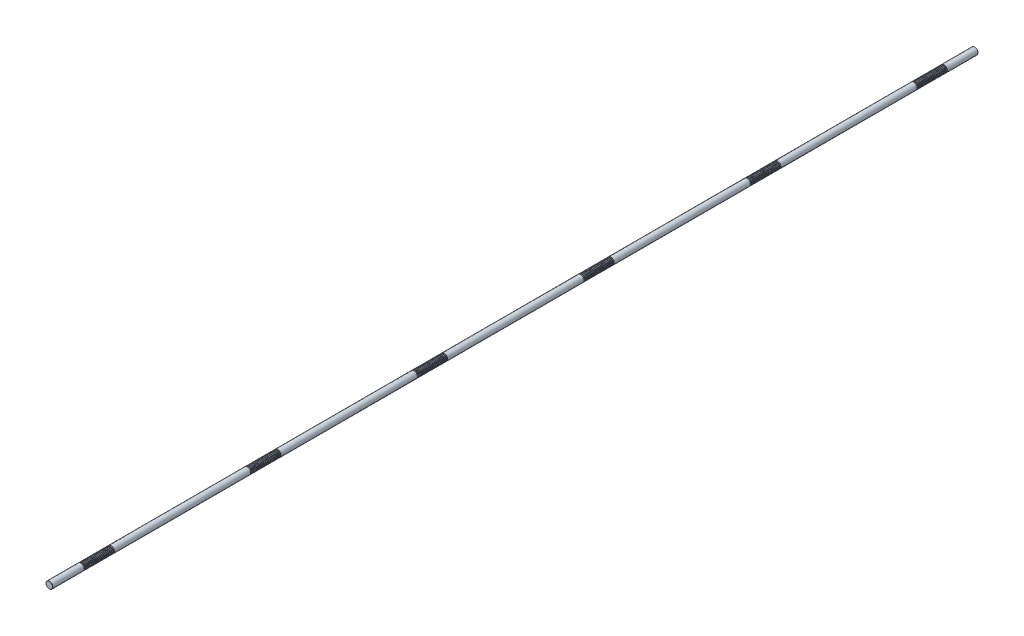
from build123d import *

# Parameters (mm, degrees)
SKETCH1_R           = 11
BOSS_EXTRUDE1_DEPTH = 1500
CHAMFER1_SIZE       = 0.55
LPATTERN1_COUNT     = 20
LPATTERN1_PITCH     = 5
LPATTERN2_COUNT     = 6
LPATTERN2_PITCH     = 540


with BuildPart() as part:
    # Sketch1 → Boss-Extrude1 (new, symmetric)
    with BuildSketch(Plane.XY):
        Circle(SKETCH1_R)
    extrude(amount=BOSS_EXTRUDE1_DEPTH, both=True)

    # Chamfer1
    chamfer1_edges = [part.edges().sort_by_distance(p)[0] for p in [
        (-11, 0, -1500),
        (-11, 0, 1500),
    ]]
    chamfer(chamfer1_edges, length=CHAMFER1_SIZE)

    # Sketch2 → Cut-Revolve1 (revolve, cut)
    with BuildSketch(Plane(origin=(0, 0, 0), x_dir=(0, 0, -1), z_dir=(1, 0, 0)), mode=Mode.PRIVATE) as cut_revolve1_sk:
        Polygon((1400.36843014, 11), (1397.13156986, 11), (1397.86843014, 8.25), (1399.63156986, 8.25), align=None)
    cut_revolve1 = revolve(cut_revolve1_sk.sketch.rotate(Axis((0, 0, 1500), (0, 0, -1)), 90), axis=Axis((0, 0, 1500), (0, 0, -1)), mode=Mode.SUBTRACT)

    # LPattern1: Cut-Revolve1 ×20
    with Locations(*[(0, 0, i * LPATTERN1_PITCH) for i in range(1, LPATTERN1_COUNT)]):
        add(cut_revolve1, mode=Mode.SUBTRACT)

    # LPattern2: Cut-Revolve1 ×6
    with Locations(*[(0, 0, i * LPATTERN2_PITCH) for i in range(1, LPATTERN2_COUNT)]):
        add(cut_revolve1, mode=Mode.SUBTRACT)

    # LPattern2 copy 1 sketch → LPattern2 copy 1 (revolve, cut)
    with BuildSketch(Plane(origin=(0, 0, 545), x_dir=(0, 0, -1), z_dir=(1, 0, 0))):
        Polygon((1400.36843014, 11), (1397.13156986, 11), (1397.86843014, 8.25), (1399.63156986, 8.25), align=None)
    revolve(axis=Axis((0, 0, 2045), (0, 0, -1)), mode=Mode.SUBTRACT)

    # LPattern2 copy 2 sketch → LPattern2 copy 2 (revolve, cut)
    with BuildSketch(Plane(origin=(0, 0, 1085), x_dir=(0, 0, -1), z_dir=(1, 0, 0))):
        Polygon((1400.36843014, 11), (1397.13156986, 11), (1397.86843014, 8.25), (1399.63156986, 8.25), align=None)
    revolve(axis=Axis((0, 0, 2585), (0, 0, -1)), mode=Mode.SUBTRACT)

    # LPattern2 copy 3 sketch → LPattern2 copy 3 (revolve, cut)
    with BuildSketch(Plane(origin=(0, 0, 1625), x_dir=(0, 0, -1), z_dir=(1, 0, 0))):
        Polygon((1400.36843014, 11), (1397.13156986, 11), (1397.86843014, 8.25), (1399.63156986, 8.25), align=None)
    revolve(axis=Axis((0, 0, 3125), (0, 0, -1)), mode=Mode.SUBTRACT)

    # LPattern2 copy 4 sketch → LPattern2 copy 4 (revolve, cut)
    with BuildSketch(Plane(origin=(0, 0, 2165), x_dir=(0, 0, -1), z_dir=(1, 0, 0))):
        Polygon((1400.36843014, 11), (1397.13156986, 11), (1397.86843014, 8.25), (1399.63156986, 8.25), align=None)
    revolve(axis=Axis((0, 0, 3665), (0, 0, -1)), mode=Mode.SUBTRACT)

    # LPattern2 copy 5 sketch → LPattern2 copy 5 (revolve, cut)
    with BuildSketch(Plane(origin=(0, 0, 2705), x_dir=(0, 0, -1), z_dir=(1, 0, 0))):
        Polygon((1400.36843014, 11), (1397.13156986, 11), (1397.86843014, 8.25), (1399.63156986, 8.25), align=None)
    revolve(axis=Axis((0, 0, 4205), (0, 0, -1)), mode=Mode.SUBTRACT)

    # LPattern2 copy 6 sketch → LPattern2 copy 6 (revolve, cut)
    with BuildSketch(Plane(origin=(0, 0, 550), x_dir=(0, 0, -1), z_dir=(1, 0, 0))):
        Polygon((1400.36843014, 11), (1397.13156986, 11), (1397.86843014, 8.25), (1399.63156986, 8.25), align=None)
    revolve(axis=Axis((0, 0, 2050), (0, 0, -1)), mode=Mode.SUBTRACT)

    # LPattern2 copy 7 sketch → LPattern2 copy 7 (revolve, cut)
    with BuildSketch(Plane(origin=(0, 0, 1090), x_dir=(0, 0, -1), z_dir=(1, 0, 0))):
        Polygon((1400.36843014, 11), (1397.13156986, 11), (1397.86843014, 8.25), (1399.63156986, 8.25), align=None)
    revolve(axis=Axis((0, 0, 2590), (0, 0, -1)), mode=Mode.SUBTRACT)

    # LPattern2 copy 8 sketch → LPattern2 copy 8 (revolve, cut)
    with BuildSketch(Plane(origin=(0, 0, 1630), x_dir=(0, 0, -1), z_dir=(1, 0, 0))):
        Polygon((1400.36843014, 11), (1397.13156986, 11), (1397.86843014, 8.25), (1399.63156986, 8.25), align=None)
    revolve(axis=Axis((0, 0, 3130), (0, 0, -1)), mode=Mode.SUBTRACT)

    # LPattern2 copy 9 sketch → LPattern2 copy 9 (revolve, cut)
    with BuildSketch(Plane(origin=(0, 0, 2170), x_dir=(0, 0, -1), z_dir=(1, 0, 0))):
        Polygon((1400.36843014, 11), (1397.13156986, 11), (1397.86843014, 8.25), (1399.63156986, 8.25), align=None)
    revolve(axis=Axis((0, 0, 3670), (0, 0, -1)), mode=Mode.SUBTRACT)

    # LPattern2 copy 10 sketch → LPattern2 copy 10 (revolve, cut)
    with BuildSketch(Plane(origin=(0, 0, 2710), x_dir=(0, 0, -1), z_dir=(1, 0, 0))):
        Polygon((1400.36843014, 11), (1397.13156986, 11), (1397.86843014, 8.25), (1399.63156986, 8.25), align=None)
    revolve(axis=Axis((0, 0, 4210), (0, 0, -1)), mode=Mode.SUBTRACT)

    # LPattern2 copy 11 sketch → LPattern2 copy 11 (revolve, cut)
    with BuildSketch(Plane(origin=(0, 0, 555), x_dir=(0, 0, -1), z_dir=(1, 0, 0))):
        Polygon((1400.36843014, 11), (1397.13156986, 11), (1397.86843014, 8.25), (1399.63156986, 8.25), align=None)
    revolve(axis=Axis((0, 0, 2055), (0, 0, -1)), mode=Mode.SUBTRACT)

    # LPattern2 copy 12 sketch → LPattern2 copy 12 (revolve, cut)
    with BuildSketch(Plane(origin=(0, 0, 1095), x_dir=(0, 0, -1), z_dir=(1, 0, 0))):
        Polygon((1400.36843014, 11), (1397.13156986, 11), (1397.86843014, 8.25), (1399.63156986, 8.25), align=None)
    revolve(axis=Axis((0, 0, 2595), (0, 0, -1)), mode=Mode.SUBTRACT)

    # LPattern2 copy 13 sketch → LPattern2 copy 13 (revolve, cut)
    with BuildSketch(Plane(origin=(0, 0, 1635), x_dir=(0, 0, -1), z_dir=(1, 0, 0))):
        Polygon((1400.36843014, 11), (1397.13156986, 11), (1397.86843014, 8.25), (1399.63156986, 8.25), align=None)
    revolve(axis=Axis((0, 0, 3135), (0, 0, -1)), mode=Mode.SUBTRACT)

    # LPattern2 copy 14 sketch → LPattern2 copy 14 (revolve, cut)
    with BuildSketch(Plane(origin=(0, 0, 2175), x_dir=(0, 0, -1), z_dir=(1, 0, 0))):
        Polygon((1400.36843014, 11), (1397.13156986, 11), (1397.86843014, 8.25), (1399.63156986, 8.25), align=None)
    revolve(axis=Axis((0, 0, 3675), (0, 0, -1)), mode=Mode.SUBTRACT)

    # LPattern2 copy 15 sketch → LPattern2 copy 15 (revolve, cut)
    with BuildSketch(Plane(origin=(0, 0, 2715), x_dir=(0, 0, -1), z_dir=(1, 0, 0))):
        Polygon((1400.36843014, 11), (1397.13156986, 11), (1397.86843014, 8.25), (1399.63156986, 8.25), align=None)
    revolve(axis=Axis((0, 0, 4215), (0, 0, -1)), mode=Mode.SUBTRACT)

    # LPattern2 copy 16 sketch → LPattern2 copy 16 (revolve, cut)
    with BuildSketch(Plane(origin=(0, 0, 560), x_dir=(0, 0, -1), z_dir=(1, 0, 0))):
        Polygon((1400.36843014, 11), (1397.13156986, 11), (1397.86843014, 8.25), (1399.63156986, 8.25), align=None)
    revolve(axis=Axis((0, 0, 2060), (0, 0, -1)), mode=Mode.SUBTRACT)

    # LPattern2 copy 17 sketch → LPattern2 copy 17 (revolve, cut)
    with BuildSketch(Plane(origin=(0, 0, 1100), x_dir=(0, 0, -1), z_dir=(1, 0, 0))):
        Polygon((1400.36843014, 11), (1397.13156986, 11), (1397.86843014, 8.25), (1399.63156986, 8.25), align=None)
    revolve(axis=Axis((0, 0, 2600), (0, 0, -1)), mode=Mode.SUBTRACT)

    # LPattern2 copy 18 sketch → LPattern2 copy 18 (revolve, cut)
    with BuildSketch(Plane(origin=(0, 0, 1640), x_dir=(0, 0, -1), z_dir=(1, 0, 0))):
        Polygon((1400.36843014, 11), (1397.13156986, 11), (1397.86843014, 8.25), (1399.63156986, 8.25), align=None)
    revolve(axis=Axis((0, 0, 3140), (0, 0, -1)), mode=Mode.SUBTRACT)

    # LPattern2 copy 19 sketch → LPattern2 copy 19 (revolve, cut)
    with BuildSketch(Plane(origin=(0, 0, 2180), x_dir=(0, 0, -1), z_dir=(1, 0, 0))):
        Polygon((1400.36843014, 11), (1397.13156986, 11), (1397.86843014, 8.25), (1399.63156986, 8.25), align=None)
    revolve(axis=Axis((0, 0, 3680), (0, 0, -1)), mode=Mode.SUBTRACT)

    # LPattern2 copy 20 sketch → LPattern2 copy 20 (revolve, cut)
    with BuildSketch(Plane(origin=(0, 0, 2720), x_dir=(0, 0, -1), z_dir=(1, 0, 0))):
        Polygon((1400.36843014, 11), (1397.13156986, 11), (1397.86843014, 8.25), (1399.63156986, 8.25), align=None)
    revolve(axis=Axis((0, 0, 4220), (0, 0, -1)), mode=Mode.SUBTRACT)

    # LPattern2 copy 21 sketch → LPattern2 copy 21 (revolve, cut)
    with BuildSketch(Plane(origin=(0, 0, 565), x_dir=(0, 0, -1), z_dir=(1, 0, 0))):
        Polygon((1400.36843014, 11), (1397.13156986, 11), (1397.86843014, 8.25), (1399.63156986, 8.25), align=None)
    revolve(axis=Axis((0, 0, 2065), (0, 0, -1)), mode=Mode.SUBTRACT)

    # LPattern2 copy 22 sketch → LPattern2 copy 22 (revolve, cut)
    with BuildSketch(Plane(origin=(0, 0, 1105), x_dir=(0, 0, -1), z_dir=(1, 0, 0))):
        Polygon((1400.36843014, 11), (1397.13156986, 11), (1397.86843014, 8.25), (1399.63156986, 8.25), align=None)
    revolve(axis=Axis((0, 0, 2605), (0, 0, -1)), mode=Mode.SUBTRACT)

    # LPattern2 copy 23 sketch → LPattern2 copy 23 (revolve, cut)
    with BuildSketch(Plane(origin=(0, 0, 1645), x_dir=(0, 0, -1), z_dir=(1, 0, 0))):
        Polygon((1400.36843014, 11), (1397.13156986, 11), (1397.86843014, 8.25), (1399.63156986, 8.25), align=None)
    revolve(axis=Axis((0, 0, 3145), (0, 0, -1)), mode=Mode.SUBTRACT)

    # LPattern2 copy 24 sketch → LPattern2 copy 24 (revolve, cut)
    with BuildSketch(Plane(origin=(0, 0, 2185), x_dir=(0, 0, -1), z_dir=(1, 0, 0))):
        Polygon((1400.36843014, 11), (1397.13156986, 11), (1397.86843014, 8.25), (1399.63156986, 8.25), align=None)
    revolve(axis=Axis((0, 0, 3685), (0, 0, -1)), mode=Mode.SUBTRACT)

    # LPattern2 copy 25 sketch → LPattern2 copy 25 (revolve, cut)
    with BuildSketch(Plane(origin=(0, 0, 2725), x_dir=(0, 0, -1), z_dir=(1, 0, 0))):
        Polygon((1400.36843014, 11), (1397.13156986, 11), (1397.86843014, 8.25), (1399.63156986, 8.25), align=None)
    revolve(axis=Axis((0, 0, 4225), (0, 0, -1)), mode=Mode.SUBTRACT)

    # LPattern2 copy 26 sketch → LPattern2 copy 26 (revolve, cut)
    with BuildSketch(Plane(origin=(0, 0, 570), x_dir=(0, 0, -1), z_dir=(1, 0, 0))):
        Polygon((1400.36843014, 11), (1397.13156986, 11), (1397.86843014, 8.25), (1399.63156986, 8.25), align=None)
    revolve(axis=Axis((0, 0, 2070), (0, 0, -1)), mode=Mode.SUBTRACT)

    # LPattern2 copy 27 sketch → LPattern2 copy 27 (revolve, cut)
    with BuildSketch(Plane(origin=(0, 0, 1110), x_dir=(0, 0, -1), z_dir=(1, 0, 0))):
        Polygon((1400.36843014, 11), (1397.13156986, 11), (1397.86843014, 8.25), (1399.63156986, 8.25), align=None)
    revolve(axis=Axis((0, 0, 2610), (0, 0, -1)), mode=Mode.SUBTRACT)

    # LPattern2 copy 28 sketch → LPattern2 copy 28 (revolve, cut)
    with BuildSketch(Plane(origin=(0, 0, 1650), x_dir=(0, 0, -1), z_dir=(1, 0, 0))):
        Polygon((1400.36843014, 11), (1397.13156986, 11), (1397.86843014, 8.25), (1399.63156986, 8.25), align=None)
    revolve(axis=Axis((0, 0, 3150), (0, 0, -1)), mode=Mode.SUBTRACT)

    # LPattern2 copy 29 sketch → LPattern2 copy 29 (revolve, cut)
    with BuildSketch(Plane(origin=(0, 0, 2190), x_dir=(0, 0, -1), z_dir=(1, 0, 0))):
        Polygon((1400.36843014, 11), (1397.13156986, 11), (1397.86843014, 8.25), (1399.63156986, 8.25), align=None)
    revolve(axis=Axis((0, 0, 3690), (0, 0, -1)), mode=Mode.SUBTRACT)

    # LPattern2 copy 30 sketch → LPattern2 copy 30 (revolve, cut)
    with BuildSketch(Plane(origin=(0, 0, 2730), x_dir=(0, 0, -1), z_dir=(1, 0, 0))):
        Polygon((1400.36843014, 11), (1397.13156986, 11), (1397.86843014, 8.25), (1399.63156986, 8.25), align=None)
    revolve(axis=Axis((0, 0, 4230), (0, 0, -1)), mode=Mode.SUBTRACT)

    # LPattern2 copy 31 sketch → LPattern2 copy 31 (revolve, cut)
    with BuildSketch(Plane(origin=(0, 0, 575), x_dir=(0, 0, -1), z_dir=(1, 0, 0))):
        Polygon((1400.36843014, 11), (1397.13156986, 11), (1397.86843014, 8.25), (1399.63156986, 8.25), align=None)
    revolve(axis=Axis((0, 0, 2075), (0, 0, -1)), mode=Mode.SUBTRACT)

    # LPattern2 copy 32 sketch → LPattern2 copy 32 (revolve, cut)
    with BuildSketch(Plane(origin=(0, 0, 1115), x_dir=(0, 0, -1), z_dir=(1, 0, 0))):
        Polygon((1400.36843014, 11), (1397.13156986, 11), (1397.86843014, 8.25), (1399.63156986, 8.25), align=None)
    revolve(axis=Axis((0, 0, 2615), (0, 0, -1)), mode=Mode.SUBTRACT)

    # LPattern2 copy 33 sketch → LPattern2 copy 33 (revolve, cut)
    with BuildSketch(Plane(origin=(0, 0, 1655), x_dir=(0, 0, -1), z_dir=(1, 0, 0))):
        Polygon((1400.36843014, 11), (1397.13156986, 11), (1397.86843014, 8.25), (1399.63156986, 8.25), align=None)
    revolve(axis=Axis((0, 0, 3155), (0, 0, -1)), mode=Mode.SUBTRACT)

    # LPattern2 copy 34 sketch → LPattern2 copy 34 (revolve, cut)
    with BuildSketch(Plane(origin=(0, 0, 2195), x_dir=(0, 0, -1), z_dir=(1, 0, 0))):
        Polygon((1400.36843014, 11), (1397.13156986, 11), (1397.86843014, 8.25), (1399.63156986, 8.25), align=None)
    revolve(axis=Axis((0, 0, 3695), (0, 0, -1)), mode=Mode.SUBTRACT)

    # LPattern2 copy 35 sketch → LPattern2 copy 35 (revolve, cut)
    with BuildSketch(Plane(origin=(0, 0, 2735), x_dir=(0, 0, -1), z_dir=(1, 0, 0))):
        Polygon((1400.36843014, 11), (1397.13156986, 11), (1397.86843014, 8.25), (1399.63156986, 8.25), align=None)
    revolve(axis=Axis((0, 0, 4235), (0, 0, -1)), mode=Mode.SUBTRACT)

    # LPattern2 copy 36 sketch → LPattern2 copy 36 (revolve, cut)
    with BuildSketch(Plane(origin=(0, 0, 580), x_dir=(0, 0, -1), z_dir=(1, 0, 0))):
        Polygon((1400.36843014, 11), (1397.13156986, 11), (1397.86843014, 8.25), (1399.63156986, 8.25), align=None)
    revolve(axis=Axis((0, 0, 2080), (0, 0, -1)), mode=Mode.SUBTRACT)

    # LPattern2 copy 37 sketch → LPattern2 copy 37 (revolve, cut)
    with BuildSketch(Plane(origin=(0, 0, 1120), x_dir=(0, 0, -1), z_dir=(1, 0, 0))):
        Polygon((1400.36843014, 11), (1397.13156986, 11), (1397.86843014, 8.25), (1399.63156986, 8.25), align=None)
    revolve(axis=Axis((0, 0, 2620), (0, 0, -1)), mode=Mode.SUBTRACT)

    # LPattern2 copy 38 sketch → LPattern2 copy 38 (revolve, cut)
    with BuildSketch(Plane(origin=(0, 0, 1660), x_dir=(0, 0, -1), z_dir=(1, 0, 0))):
        Polygon((1400.36843014, 11), (1397.13156986, 11), (1397.86843014, 8.25), (1399.63156986, 8.25), align=None)
    revolve(axis=Axis((0, 0, 3160), (0, 0, -1)), mode=Mode.SUBTRACT)

    # LPattern2 copy 39 sketch → LPattern2 copy 39 (revolve, cut)
    with BuildSketch(Plane(origin=(0, 0, 2200), x_dir=(0, 0, -1), z_dir=(1, 0, 0))):
        Polygon((1400.36843014, 11), (1397.13156986, 11), (1397.86843014, 8.25), (1399.63156986, 8.25), align=None)
    revolve(axis=Axis((0, 0, 3700), (0, 0, -1)), mode=Mode.SUBTRACT)

    # LPattern2 copy 40 sketch → LPattern2 copy 40 (revolve, cut)
    with BuildSketch(Plane(origin=(0, 0, 2740), x_dir=(0, 0, -1), z_dir=(1, 0, 0))):
        Polygon((1400.36843014, 11), (1397.13156986, 11), (1397.86843014, 8.25), (1399.63156986, 8.25), align=None)
    revolve(axis=Axis((0, 0, 4240), (0, 0, -1)), mode=Mode.SUBTRACT)

    # LPattern2 copy 41 sketch → LPattern2 copy 41 (revolve, cut)
    with BuildSketch(Plane(origin=(0, 0, 585), x_dir=(0, 0, -1), z_dir=(1, 0, 0))):
        Polygon((1400.36843014, 11), (1397.13156986, 11), (1397.86843014, 8.25), (1399.63156986, 8.25), align=None)
    revolve(axis=Axis((0, 0, 2085), (0, 0, -1)), mode=Mode.SUBTRACT)

    # LPattern2 copy 42 sketch → LPattern2 copy 42 (revolve, cut)
    with BuildSketch(Plane(origin=(0, 0, 1125), x_dir=(0, 0, -1), z_dir=(1, 0, 0))):
        Polygon((1400.36843014, 11), (1397.13156986, 11), (1397.86843014, 8.25), (1399.63156986, 8.25), align=None)
    revolve(axis=Axis((0, 0, 2625), (0, 0, -1)), mode=Mode.SUBTRACT)

    # LPattern2 copy 43 sketch → LPattern2 copy 43 (revolve, cut)
    with BuildSketch(Plane(origin=(0, 0, 1665), x_dir=(0, 0, -1), z_dir=(1, 0, 0))):
        Polygon((1400.36843014, 11), (1397.13156986, 11), (1397.86843014, 8.25), (1399.63156986, 8.25), align=None)
    revolve(axis=Axis((0, 0, 3165), (0, 0, -1)), mode=Mode.SUBTRACT)

    # LPattern2 copy 44 sketch → LPattern2 copy 44 (revolve, cut)
    with BuildSketch(Plane(origin=(0, 0, 2205), x_dir=(0, 0, -1), z_dir=(1, 0, 0))):
        Polygon((1400.36843014, 11), (1397.13156986, 11), (1397.86843014, 8.25), (1399.63156986, 8.25), align=None)
    revolve(axis=Axis((0, 0, 3705), (0, 0, -1)), mode=Mode.SUBTRACT)

    # LPattern2 copy 45 sketch → LPattern2 copy 45 (revolve, cut)
    with BuildSketch(Plane(origin=(0, 0, 2745), x_dir=(0, 0, -1), z_dir=(1, 0, 0))):
        Polygon((1400.36843014, 11), (1397.13156986, 11), (1397.86843014, 8.25), (1399.63156986, 8.25), align=None)
    revolve(axis=Axis((0, 0, 4245), (0, 0, -1)), mode=Mode.SUBTRACT)

    # LPattern2 copy 46 sketch → LPattern2 copy 46 (revolve, cut)
    with BuildSketch(Plane(origin=(0, 0, 590), x_dir=(0, 0, -1), z_dir=(1, 0, 0))):
        Polygon((1400.36843014, 11), (1397.13156986, 11), (1397.86843014, 8.25), (1399.63156986, 8.25), align=None)
    revolve(axis=Axis((0, 0, 2090), (0, 0, -1)), mode=Mode.SUBTRACT)

    # LPattern2 copy 47 sketch → LPattern2 copy 47 (revolve, cut)
    with BuildSketch(Plane(origin=(0, 0, 1130), x_dir=(0, 0, -1), z_dir=(1, 0, 0))):
        Polygon((1400.36843014, 11), (1397.13156986, 11), (1397.86843014, 8.25), (1399.63156986, 8.25), align=None)
    revolve(axis=Axis((0, 0, 2630), (0, 0, -1)), mode=Mode.SUBTRACT)

    # LPattern2 copy 48 sketch → LPattern2 copy 48 (revolve, cut)
    with BuildSketch(Plane(origin=(0, 0, 1670), x_dir=(0, 0, -1), z_dir=(1, 0, 0))):
        Polygon((1400.36843014, 11), (1397.13156986, 11), (1397.86843014, 8.25), (1399.63156986, 8.25), align=None)
    revolve(axis=Axis((0, 0, 3170), (0, 0, -1)), mode=Mode.SUBTRACT)

    # LPattern2 copy 49 sketch → LPattern2 copy 49 (revolve, cut)
    with BuildSketch(Plane(origin=(0, 0, 2210), x_dir=(0, 0, -1), z_dir=(1, 0, 0))):
        Polygon((1400.36843014, 11), (1397.13156986, 11), (1397.86843014, 8.25), (1399.63156986, 8.25), align=None)
    revolve(axis=Axis((0, 0, 3710), (0, 0, -1)), mode=Mode.SUBTRACT)

    # LPattern2 copy 50 sketch → LPattern2 copy 50 (revolve, cut)
    with BuildSketch(Plane(origin=(0, 0, 2750), x_dir=(0, 0, -1), z_dir=(1, 0, 0))):
        Polygon((1400.36843014, 11), (1397.13156986, 11), (1397.86843014, 8.25), (1399.63156986, 8.25), align=None)
    revolve(axis=Axis((0, 0, 4250), (0, 0, -1)), mode=Mode.SUBTRACT)

    # LPattern2 copy 51 sketch → LPattern2 copy 51 (revolve, cut)
    with BuildSketch(Plane(origin=(0, 0, 595), x_dir=(0, 0, -1), z_dir=(1, 0, 0))):
        Polygon((1400.36843014, 11), (1397.13156986, 11), (1397.86843014, 8.25), (1399.63156986, 8.25), align=None)
    revolve(axis=Axis((0, 0, 2095), (0, 0, -1)), mode=Mode.SUBTRACT)

    # LPattern2 copy 52 sketch → LPattern2 copy 52 (revolve, cut)
    with BuildSketch(Plane(origin=(0, 0, 1135), x_dir=(0, 0, -1), z_dir=(1, 0, 0))):
        Polygon((1400.36843014, 11), (1397.13156986, 11), (1397.86843014, 8.25), (1399.63156986, 8.25), align=None)
    revolve(axis=Axis((0, 0, 2635), (0, 0, -1)), mode=Mode.SUBTRACT)

    # LPattern2 copy 53 sketch → LPattern2 copy 53 (revolve, cut)
    with BuildSketch(Plane(origin=(0, 0, 1675), x_dir=(0, 0, -1), z_dir=(1, 0, 0))):
        Polygon((1400.36843014, 11), (1397.13156986, 11), (1397.86843014, 8.25), (1399.63156986, 8.25), align=None)
    revolve(axis=Axis((0, 0, 3175), (0, 0, -1)), mode=Mode.SUBTRACT)

    # LPattern2 copy 54 sketch → LPattern2 copy 54 (revolve, cut)
    with BuildSketch(Plane(origin=(0, 0, 2215), x_dir=(0, 0, -1), z_dir=(1, 0, 0))):
        Polygon((1400.36843014, 11), (1397.13156986, 11), (1397.86843014, 8.25), (1399.63156986, 8.25), align=None)
    revolve(axis=Axis((0, 0, 3715), (0, 0, -1)), mode=Mode.SUBTRACT)

    # LPattern2 copy 55 sketch → LPattern2 copy 55 (revolve, cut)
    with BuildSketch(Plane(origin=(0, 0, 2755), x_dir=(0, 0, -1), z_dir=(1, 0, 0))):
        Polygon((1400.36843014, 11), (1397.13156986, 11), (1397.86843014, 8.25), (1399.63156986, 8.25), align=None)
    revolve(axis=Axis((0, 0, 4255), (0, 0, -1)), mode=Mode.SUBTRACT)

    # LPattern2 copy 56 sketch → LPattern2 copy 56 (revolve, cut)
    with BuildSketch(Plane(origin=(0, 0, 600), x_dir=(0, 0, -1), z_dir=(1, 0, 0))):
        Polygon((1400.36843014, 11), (1397.13156986, 11), (1397.86843014, 8.25), (1399.63156986, 8.25), align=None)
    revolve(axis=Axis((0, 0, 2100), (0, 0, -1)), mode=Mode.SUBTRACT)

    # LPattern2 copy 57 sketch → LPattern2 copy 57 (revolve, cut)
    with BuildSketch(Plane(origin=(0, 0, 1140), x_dir=(0, 0, -1), z_dir=(1, 0, 0))):
        Polygon((1400.36843014, 11), (1397.13156986, 11), (1397.86843014, 8.25), (1399.63156986, 8.25), align=None)
    revolve(axis=Axis((0, 0, 2640), (0, 0, -1)), mode=Mode.SUBTRACT)

    # LPattern2 copy 58 sketch → LPattern2 copy 58 (revolve, cut)
    with BuildSketch(Plane(origin=(0, 0, 1680), x_dir=(0, 0, -1), z_dir=(1, 0, 0))):
        Polygon((1400.36843014, 11), (1397.13156986, 11), (1397.86843014, 8.25), (1399.63156986, 8.25), align=None)
    revolve(axis=Axis((0, 0, 3180), (0, 0, -1)), mode=Mode.SUBTRACT)

    # LPattern2 copy 59 sketch → LPattern2 copy 59 (revolve, cut)
    with BuildSketch(Plane(origin=(0, 0, 2220), x_dir=(0, 0, -1), z_dir=(1, 0, 0))):
        Polygon((1400.36843014, 11), (1397.13156986, 11), (1397.86843014, 8.25), (1399.63156986, 8.25), align=None)
    revolve(axis=Axis((0, 0, 3720), (0, 0, -1)), mode=Mode.SUBTRACT)

    # LPattern2 copy 60 sketch → LPattern2 copy 60 (revolve, cut)
    with BuildSketch(Plane(origin=(0, 0, 2760), x_dir=(0, 0, -1), z_dir=(1, 0, 0))):
        Polygon((1400.36843014, 11), (1397.13156986, 11), (1397.86843014, 8.25), (1399.63156986, 8.25), align=None)
    revolve(axis=Axis((0, 0, 4260), (0, 0, -1)), mode=Mode.SUBTRACT)

    # LPattern2 copy 61 sketch → LPattern2 copy 61 (revolve, cut)
    with BuildSketch(Plane(origin=(0, 0, 605), x_dir=(0, 0, -1), z_dir=(1, 0, 0))):
        Polygon((1400.36843014, 11), (1397.13156986, 11), (1397.86843014, 8.25), (1399.63156986, 8.25), align=None)
    revolve(axis=Axis((0, 0, 2105), (0, 0, -1)), mode=Mode.SUBTRACT)

    # LPattern2 copy 62 sketch → LPattern2 copy 62 (revolve, cut)
    with BuildSketch(Plane(origin=(0, 0, 1145), x_dir=(0, 0, -1), z_dir=(1, 0, 0))):
        Polygon((1400.36843014, 11), (1397.13156986, 11), (1397.86843014, 8.25), (1399.63156986, 8.25), align=None)
    revolve(axis=Axis((0, 0, 2645), (0, 0, -1)), mode=Mode.SUBTRACT)

    # LPattern2 copy 63 sketch → LPattern2 copy 63 (revolve, cut)
    with BuildSketch(Plane(origin=(0, 0, 1685), x_dir=(0, 0, -1), z_dir=(1, 0, 0))):
        Polygon((1400.36843014, 11), (1397.13156986, 11), (1397.86843014, 8.25), (1399.63156986, 8.25), align=None)
    revolve(axis=Axis((0, 0, 3185), (0, 0, -1)), mode=Mode.SUBTRACT)

    # LPattern2 copy 64 sketch → LPattern2 copy 64 (revolve, cut)
    with BuildSketch(Plane(origin=(0, 0, 2225), x_dir=(0, 0, -1), z_dir=(1, 0, 0))):
        Polygon((1400.36843014, 11), (1397.13156986, 11), (1397.86843014, 8.25), (1399.63156986, 8.25), align=None)
    revolve(axis=Axis((0, 0, 3725), (0, 0, -1)), mode=Mode.SUBTRACT)

    # LPattern2 copy 65 sketch → LPattern2 copy 65 (revolve, cut)
    with BuildSketch(Plane(origin=(0, 0, 2765), x_dir=(0, 0, -1), z_dir=(1, 0, 0))):
        Polygon((1400.36843014, 11), (1397.13156986, 11), (1397.86843014, 8.25), (1399.63156986, 8.25), align=None)
    revolve(axis=Axis((0, 0, 4265), (0, 0, -1)), mode=Mode.SUBTRACT)

    # LPattern2 copy 66 sketch → LPattern2 copy 66 (revolve, cut)
    with BuildSketch(Plane(origin=(0, 0, 610), x_dir=(0, 0, -1), z_dir=(1, 0, 0))):
        Polygon((1400.36843014, 11), (1397.13156986, 11), (1397.86843014, 8.25), (1399.63156986, 8.25), align=None)
    revolve(axis=Axis((0, 0, 2110), (0, 0, -1)), mode=Mode.SUBTRACT)

    # LPattern2 copy 67 sketch → LPattern2 copy 67 (revolve, cut)
    with BuildSketch(Plane(origin=(0, 0, 1150), x_dir=(0, 0, -1), z_dir=(1, 0, 0))):
        Polygon((1400.36843014, 11), (1397.13156986, 11), (1397.86843014, 8.25), (1399.63156986, 8.25), align=None)
    revolve(axis=Axis((0, 0, 2650), (0, 0, -1)), mode=Mode.SUBTRACT)

    # LPattern2 copy 68 sketch → LPattern2 copy 68 (revolve, cut)
    with BuildSketch(Plane(origin=(0, 0, 1690), x_dir=(0, 0, -1), z_dir=(1, 0, 0))):
        Polygon((1400.36843014, 11), (1397.13156986, 11), (1397.86843014, 8.25), (1399.63156986, 8.25), align=None)
    revolve(axis=Axis((0, 0, 3190), (0, 0, -1)), mode=Mode.SUBTRACT)

    # LPattern2 copy 69 sketch → LPattern2 copy 69 (revolve, cut)
    with BuildSketch(Plane(origin=(0, 0, 2230), x_dir=(0, 0, -1), z_dir=(1, 0, 0))):
        Polygon((1400.36843014, 11), (1397.13156986, 11), (1397.86843014, 8.25), (1399.63156986, 8.25), align=None)
    revolve(axis=Axis((0, 0, 3730), (0, 0, -1)), mode=Mode.SUBTRACT)

    # LPattern2 copy 70 sketch → LPattern2 copy 70 (revolve, cut)
    with BuildSketch(Plane(origin=(0, 0, 2770), x_dir=(0, 0, -1), z_dir=(1, 0, 0))):
        Polygon((1400.36843014, 11), (1397.13156986, 11), (1397.86843014, 8.25), (1399.63156986, 8.25), align=None)
    revolve(axis=Axis((0, 0, 4270), (0, 0, -1)), mode=Mode.SUBTRACT)

    # LPattern2 copy 71 sketch → LPattern2 copy 71 (revolve, cut)
    with BuildSketch(Plane(origin=(0, 0, 615), x_dir=(0, 0, -1), z_dir=(1, 0, 0))):
        Polygon((1400.36843014, 11), (1397.13156986, 11), (1397.86843014, 8.25), (1399.63156986, 8.25), align=None)
    revolve(axis=Axis((0, 0, 2115), (0, 0, -1)), mode=Mode.SUBTRACT)

    # LPattern2 copy 72 sketch → LPattern2 copy 72 (revolve, cut)
    with BuildSketch(Plane(origin=(0, 0, 1155), x_dir=(0, 0, -1), z_dir=(1, 0, 0))):
        Polygon((1400.36843014, 11), (1397.13156986, 11), (1397.86843014, 8.25), (1399.63156986, 8.25), align=None)
    revolve(axis=Axis((0, 0, 2655), (0, 0, -1)), mode=Mode.SUBTRACT)

    # LPattern2 copy 73 sketch → LPattern2 copy 73 (revolve, cut)
    with BuildSketch(Plane(origin=(0, 0, 1695), x_dir=(0, 0, -1), z_dir=(1, 0, 0))):
        Polygon((1400.36843014, 11), (1397.13156986, 11), (1397.86843014, 8.25), (1399.63156986, 8.25), align=None)
    revolve(axis=Axis((0, 0, 3195), (0, 0, -1)), mode=Mode.SUBTRACT)

    # LPattern2 copy 74 sketch → LPattern2 copy 74 (revolve, cut)
    with BuildSketch(Plane(origin=(0, 0, 2235), x_dir=(0, 0, -1), z_dir=(1, 0, 0))):
        Polygon((1400.36843014, 11), (1397.13156986, 11), (1397.86843014, 8.25), (1399.63156986, 8.25), align=None)
    revolve(axis=Axis((0, 0, 3735), (0, 0, -1)), mode=Mode.SUBTRACT)

    # LPattern2 copy 75 sketch → LPattern2 copy 75 (revolve, cut)
    with BuildSketch(Plane(origin=(0, 0, 2775), x_dir=(0, 0, -1), z_dir=(1, 0, 0))):
        Polygon((1400.36843014, 11), (1397.13156986, 11), (1397.86843014, 8.25), (1399.63156986, 8.25), align=None)
    revolve(axis=Axis((0, 0, 4275), (0, 0, -1)), mode=Mode.SUBTRACT)

    # LPattern2 copy 76 sketch → LPattern2 copy 76 (revolve, cut)
    with BuildSketch(Plane(origin=(0, 0, 620), x_dir=(0, 0, -1), z_dir=(1, 0, 0))):
        Polygon((1400.36843014, 11), (1397.13156986, 11), (1397.86843014, 8.25), (1399.63156986, 8.25), align=None)
    revolve(axis=Axis((0, 0, 2120), (0, 0, -1)), mode=Mode.SUBTRACT)

    # LPattern2 copy 77 sketch → LPattern2 copy 77 (revolve, cut)
    with BuildSketch(Plane(origin=(0, 0, 1160), x_dir=(0, 0, -1), z_dir=(1, 0, 0))):
        Polygon((1400.36843014, 11), (1397.13156986, 11), (1397.86843014, 8.25), (1399.63156986, 8.25), align=None)
    revolve(axis=Axis((0, 0, 2660), (0, 0, -1)), mode=Mode.SUBTRACT)

    # LPattern2 copy 78 sketch → LPattern2 copy 78 (revolve, cut)
    with BuildSketch(Plane(origin=(0, 0, 1700), x_dir=(0, 0, -1), z_dir=(1, 0, 0))):
        Polygon((1400.36843014, 11), (1397.13156986, 11), (1397.86843014, 8.25), (1399.63156986, 8.25), align=None)
    revolve(axis=Axis((0, 0, 3200), (0, 0, -1)), mode=Mode.SUBTRACT)

    # LPattern2 copy 79 sketch → LPattern2 copy 79 (revolve, cut)
    with BuildSketch(Plane(origin=(0, 0, 2240), x_dir=(0, 0, -1), z_dir=(1, 0, 0))):
        Polygon((1400.36843014, 11), (1397.13156986, 11), (1397.86843014, 8.25), (1399.63156986, 8.25), align=None)
    revolve(axis=Axis((0, 0, 3740), (0, 0, -1)), mode=Mode.SUBTRACT)

    # LPattern2 copy 80 sketch → LPattern2 copy 80 (revolve, cut)
    with BuildSketch(Plane(origin=(0, 0, 2780), x_dir=(0, 0, -1), z_dir=(1, 0, 0))):
        Polygon((1400.36843014, 11), (1397.13156986, 11), (1397.86843014, 8.25), (1399.63156986, 8.25), align=None)
    revolve(axis=Axis((0, 0, 4280), (0, 0, -1)), mode=Mode.SUBTRACT)

    # LPattern2 copy 81 sketch → LPattern2 copy 81 (revolve, cut)
    with BuildSketch(Plane(origin=(0, 0, 625), x_dir=(0, 0, -1), z_dir=(1, 0, 0))):
        Polygon((1400.36843014, 11), (1397.13156986, 11), (1397.86843014, 8.25), (1399.63156986, 8.25), align=None)
    revolve(axis=Axis((0, 0, 2125), (0, 0, -1)), mode=Mode.SUBTRACT)

    # LPattern2 copy 82 sketch → LPattern2 copy 82 (revolve, cut)
    with BuildSketch(Plane(origin=(0, 0, 1165), x_dir=(0, 0, -1), z_dir=(1, 0, 0))):
        Polygon((1400.36843014, 11), (1397.13156986, 11), (1397.86843014, 8.25), (1399.63156986, 8.25), align=None)
    revolve(axis=Axis((0, 0, 2665), (0, 0, -1)), mode=Mode.SUBTRACT)

    # LPattern2 copy 83 sketch → LPattern2 copy 83 (revolve, cut)
    with BuildSketch(Plane(origin=(0, 0, 1705), x_dir=(0, 0, -1), z_dir=(1, 0, 0))):
        Polygon((1400.36843014, 11), (1397.13156986, 11), (1397.86843014, 8.25), (1399.63156986, 8.25), align=None)
    revolve(axis=Axis((0, 0, 3205), (0, 0, -1)), mode=Mode.SUBTRACT)

    # LPattern2 copy 84 sketch → LPattern2 copy 84 (revolve, cut)
    with BuildSketch(Plane(origin=(0, 0, 2245), x_dir=(0, 0, -1), z_dir=(1, 0, 0))):
        Polygon((1400.36843014, 11), (1397.13156986, 11), (1397.86843014, 8.25), (1399.63156986, 8.25), align=None)
    revolve(axis=Axis((0, 0, 3745), (0, 0, -1)), mode=Mode.SUBTRACT)

    # LPattern2 copy 85 sketch → LPattern2 copy 85 (revolve, cut)
    with BuildSketch(Plane(origin=(0, 0, 2785), x_dir=(0, 0, -1), z_dir=(1, 0, 0))):
        Polygon((1400.36843014, 11), (1397.13156986, 11), (1397.86843014, 8.25), (1399.63156986, 8.25), align=None)
    revolve(axis=Axis((0, 0, 4285), (0, 0, -1)), mode=Mode.SUBTRACT)

    # LPattern2 copy 86 sketch → LPattern2 copy 86 (revolve, cut)
    with BuildSketch(Plane(origin=(0, 0, 630), x_dir=(0, 0, -1), z_dir=(1, 0, 0))):
        Polygon((1400.36843014, 11), (1397.13156986, 11), (1397.86843014, 8.25), (1399.63156986, 8.25), align=None)
    revolve(axis=Axis((0, 0, 2130), (0, 0, -1)), mode=Mode.SUBTRACT)

    # LPattern2 copy 87 sketch → LPattern2 copy 87 (revolve, cut)
    with BuildSketch(Plane(origin=(0, 0, 1170), x_dir=(0, 0, -1), z_dir=(1, 0, 0))):
        Polygon((1400.36843014, 11), (1397.13156986, 11), (1397.86843014, 8.25), (1399.63156986, 8.25), align=None)
    revolve(axis=Axis((0, 0, 2670), (0, 0, -1)), mode=Mode.SUBTRACT)

    # LPattern2 copy 88 sketch → LPattern2 copy 88 (revolve, cut)
    with BuildSketch(Plane(origin=(0, 0, 1710), x_dir=(0, 0, -1), z_dir=(1, 0, 0))):
        Polygon((1400.36843014, 11), (1397.13156986, 11), (1397.86843014, 8.25), (1399.63156986, 8.25), align=None)
    revolve(axis=Axis((0, 0, 3210), (0, 0, -1)), mode=Mode.SUBTRACT)

    # LPattern2 copy 89 sketch → LPattern2 copy 89 (revolve, cut)
    with BuildSketch(Plane(origin=(0, 0, 2250), x_dir=(0, 0, -1), z_dir=(1, 0, 0))):
        Polygon((1400.36843014, 11), (1397.13156986, 11), (1397.86843014, 8.25), (1399.63156986, 8.25), align=None)
    revolve(axis=Axis((0, 0, 3750), (0, 0, -1)), mode=Mode.SUBTRACT)

    # LPattern2 copy 90 sketch → LPattern2 copy 90 (revolve, cut)
    with BuildSketch(Plane(origin=(0, 0, 2790), x_dir=(0, 0, -1), z_dir=(1, 0, 0))):
        Polygon((1400.36843014, 11), (1397.13156986, 11), (1397.86843014, 8.25), (1399.63156986, 8.25), align=None)
    revolve(axis=Axis((0, 0, 4290), (0, 0, -1)), mode=Mode.SUBTRACT)

    # LPattern2 copy 91 sketch → LPattern2 copy 91 (revolve, cut)
    with BuildSketch(Plane(origin=(0, 0, 635), x_dir=(0, 0, -1), z_dir=(1, 0, 0))):
        Polygon((1400.36843014, 11), (1397.13156986, 11), (1397.86843014, 8.25), (1399.63156986, 8.25), align=None)
    revolve(axis=Axis((0, 0, 2135), (0, 0, -1)), mode=Mode.SUBTRACT)

    # LPattern2 copy 92 sketch → LPattern2 copy 92 (revolve, cut)
    with BuildSketch(Plane(origin=(0, 0, 1175), x_dir=(0, 0, -1), z_dir=(1, 0, 0))):
        Polygon((1400.36843014, 11), (1397.13156986, 11), (1397.86843014, 8.25), (1399.63156986, 8.25), align=None)
    revolve(axis=Axis((0, 0, 2675), (0, 0, -1)), mode=Mode.SUBTRACT)

    # LPattern2 copy 93 sketch → LPattern2 copy 93 (revolve, cut)
    with BuildSketch(Plane(origin=(0, 0, 1715), x_dir=(0, 0, -1), z_dir=(1, 0, 0))):
        Polygon((1400.36843014, 11), (1397.13156986, 11), (1397.86843014, 8.25), (1399.63156986, 8.25), align=None)
    revolve(axis=Axis((0, 0, 3215), (0, 0, -1)), mode=Mode.SUBTRACT)

    # LPattern2 copy 94 sketch → LPattern2 copy 94 (revolve, cut)
    with BuildSketch(Plane(origin=(0, 0, 2255), x_dir=(0, 0, -1), z_dir=(1, 0, 0))):
        Polygon((1400.36843014, 11), (1397.13156986, 11), (1397.86843014, 8.25), (1399.63156986, 8.25), align=None)
    revolve(axis=Axis((0, 0, 3755), (0, 0, -1)), mode=Mode.SUBTRACT)

    # LPattern2 copy 95 sketch → LPattern2 copy 95 (revolve, cut)
    with BuildSketch(Plane(origin=(0, 0, 2795), x_dir=(0, 0, -1), z_dir=(1, 0, 0))):
        Polygon((1400.36843014, 11), (1397.13156986, 11), (1397.86843014, 8.25), (1399.63156986, 8.25), align=None)
    revolve(axis=Axis((0, 0, 4295), (0, 0, -1)), mode=Mode.SUBTRACT)


solid = part.part
